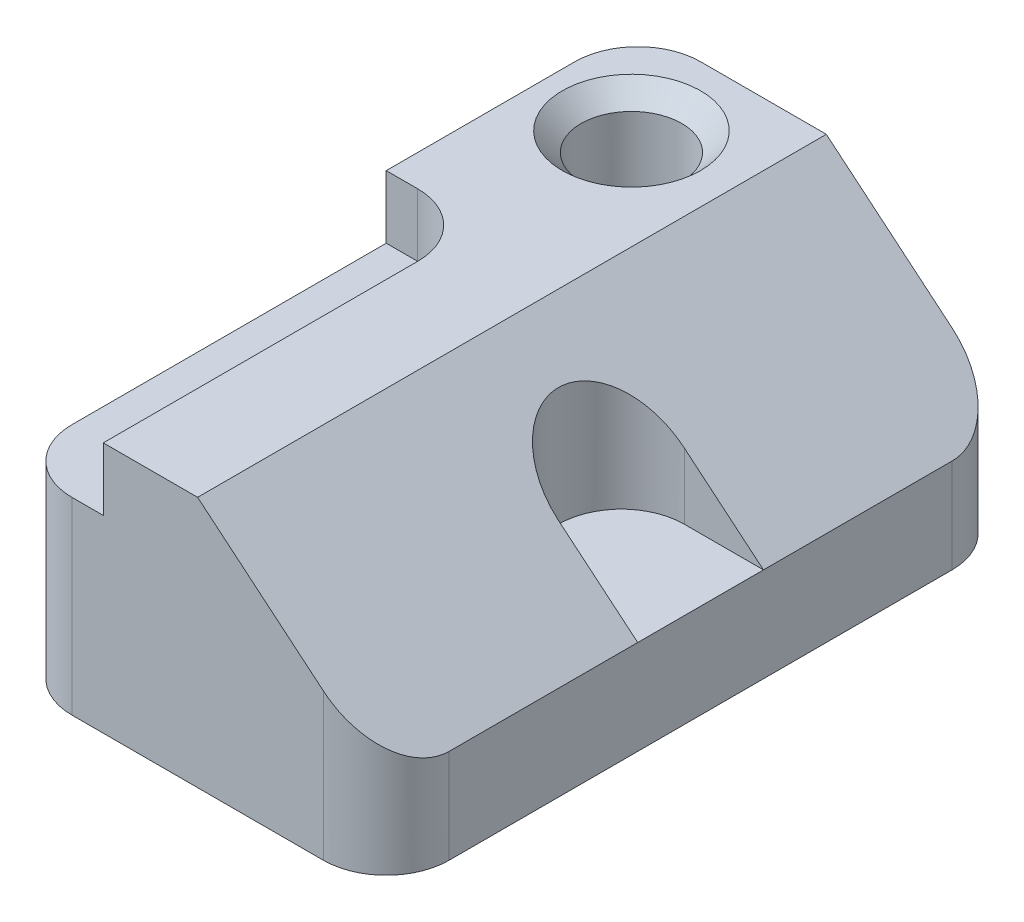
from build123d import *

# Parameters (mm, degrees)
EXTRUDE1_DEPTH     = 127
SKETCH2_R          = 10.16
CUT_EXTRUDE1_DEPTH = 157.576115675
CHAMFER1_SIZE      = 3.81
CUT_EXTRUDE2_DEPTH = 12.7
CUT_EXTRUDE3_DEPTH = 31.75
FILLET4_R          = 12.7


with BuildPart() as part:
    # Sketch1 → Extrude1 (new body)
    with BuildSketch(Plane.XY):
        Polygon((0, 0), (76.2, 0), (76.2, 19.05), (38.1, 50.8), (0, 50.8), align=None)
    extrude(amount=EXTRUDE1_DEPTH)

    # Sketch2 → Cut-Extrude1 (cut, through all)
    with BuildSketch(Plane(origin=(0, 50.8, 0), x_dir=(-1, 0, 0), z_dir=(0, 1, 0))):
        with Locations((-17.78, 19.05)):
            Circle(SKETCH2_R)
    extrude(amount=-CUT_EXTRUDE1_DEPTH, mode=Mode.SUBTRACT)

    # Chamfer1
    chamfer1_edges = [part.edges().sort_by_distance(p)[0] for p in [
        (27.94, 50.8, 19.05),
    ]]
    chamfer(chamfer1_edges, length=CHAMFER1_SIZE)

    # Sketch3 → Cut-Extrude2 (cut)
    with BuildSketch(Plane(origin=(0, 50.8, 0), x_dir=(-1, 0, 0), z_dir=(0, 1, 0))):
        with BuildLine():
            Line((0, 127), (-19.05, 127))
            Line((-19.05, 127), (-19.05, 63.5))
            ThreePointArc((-19.05, 63.5), (-15.330256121, 54.519743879), (-6.35, 50.8))
            Line((-6.35, 50.8), (0, 50.8))
            Line((0, 50.8), (0, 127))
        make_face()
    extrude(amount=-CUT_EXTRUDE2_DEPTH, mode=Mode.SUBTRACT)

    # Sketch4 → Cut-Extrude3 (cut)
    with BuildSketch(Plane(origin=(0, 50.8, 0), x_dir=(-1, 0, 0), z_dir=(0, 1, 0))):
        with BuildLine():
            Line((-76.2, 76.2), (-60.198, 76.2))
            ThreePointArc((-60.198, 76.2), (-47.498, 63.5), (-60.198, 50.8))
            Line((-60.198, 50.8), (-76.2, 50.8))
            Line((-76.2, 50.8), (-76.2, 76.2))
        make_face()
    extrude(amount=-CUT_EXTRUDE3_DEPTH, mode=Mode.SUBTRACT)

    # Fillet4
    fillet4_edges = [part.edges().sort_by_distance(p)[0] for p in [
        (76.2, 9.525, 127),
        (0, 19.05, 127),
        (76.2, 9.525, 0),
        (0, 25.4, 0),
    ]]
    fillet(fillet4_edges, radius=FILLET4_R)


solid = part.part
